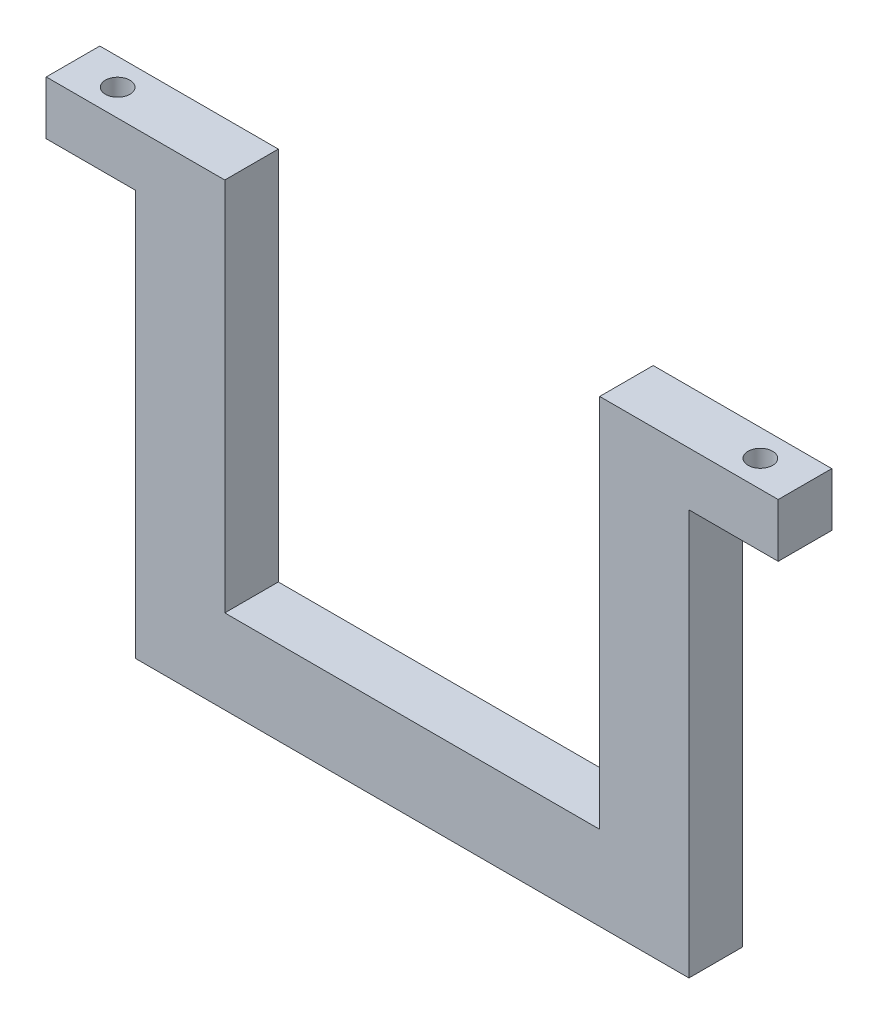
ISO-10303-21;
HEADER;
FILE_DESCRIPTION(('STEP AP214'),'2;1');
FILE_NAME('part.step','',(''),(''),'','','');
FILE_SCHEMA(('AUTOMOTIVE_DESIGN { 1 0 10303 214 1 1 1 1 }'));
ENDSEC;
DATA;
#1=APPLICATION_CONTEXT('core data for automotive mechanical design processes');
#2=APPLICATION_PROTOCOL_DEFINITION('international standard','automotive_design',2000,#1);
#3=PRODUCT_CONTEXT('',#1,'mechanical');
#4=PRODUCT('Part','Part','',(#3));
#5=PRODUCT_RELATED_PRODUCT_CATEGORY('part','',(#4));
#6=PRODUCT_DEFINITION_FORMATION('','',#4);
#7=PRODUCT_DEFINITION_CONTEXT('part definition',#1,'design');
#8=PRODUCT_DEFINITION('design','',#6,#7);
#9=PRODUCT_DEFINITION_SHAPE('','',#8);
#10=(LENGTH_UNIT() NAMED_UNIT(*) SI_UNIT(.MILLI.,.METRE.));
#11=(NAMED_UNIT(*) PLANE_ANGLE_UNIT() SI_UNIT($,.RADIAN.));
#12=(NAMED_UNIT(*) SI_UNIT($,.STERADIAN.) SOLID_ANGLE_UNIT());
#13=UNCERTAINTY_MEASURE_WITH_UNIT(LENGTH_MEASURE(1.E-05),#10,'distance_accuracy_value','');
#14=(GEOMETRIC_REPRESENTATION_CONTEXT(3) GLOBAL_UNCERTAINTY_ASSIGNED_CONTEXT((#13)) GLOBAL_UNIT_ASSIGNED_CONTEXT((#10,
#11,#12)) REPRESENTATION_CONTEXT('',''));
#15=CARTESIAN_POINT('',(0.,0.,0.));
#16=DIRECTION('',(0.,0.,1.));
#17=DIRECTION('',(1.,0.,0.));
#18=AXIS2_PLACEMENT_3D('',#15,#16,#17);
#19=CARTESIAN_POINT('',(-50.2278481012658,21.,6.));
#20=DIRECTION('',(1.,0.,0.));
#21=DIRECTION('',(0.,1.,0.));
#22=AXIS2_PLACEMENT_3D('',#19,#20,#21);
#23=PLANE('',#22);
#24=DIRECTION('',(0.,0.,1.));
#25=VECTOR('',#24,1.);
#26=CARTESIAN_POINT('',(-50.2278481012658,15.,0.));
#27=LINE('',#26,#25);
#28=CARTESIAN_POINT('',(-50.2278481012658,15.,0.));
#29=VERTEX_POINT('',#28);
#30=CARTESIAN_POINT('',(-50.2278481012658,15.,6.));
#31=VERTEX_POINT('',#30);
#32=EDGE_CURVE('E48',#29,#31,#27,.T.);
#33=ORIENTED_EDGE('',*,*,#32,.F.);
#34=DIRECTION('',(0.,-1.,0.));
#35=VECTOR('',#34,1.);
#36=CARTESIAN_POINT('',(-50.2278481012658,21.,0.));
#37=LINE('',#36,#35);
#38=CARTESIAN_POINT('',(-50.2278481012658,-30.4224633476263,0.));
#39=VERTEX_POINT('',#38);
#40=EDGE_CURVE('E147',#29,#39,#37,.T.);
#41=ORIENTED_EDGE('',*,*,#40,.T.);
#42=DIRECTION('',(0.,0.,-1.));
#43=VECTOR('',#42,1.);
#44=CARTESIAN_POINT('',(-50.2278481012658,-30.4224633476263,6.));
#45=LINE('',#44,#43);
#46=CARTESIAN_POINT('',(-50.2278481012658,-30.4224633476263,6.));
#47=VERTEX_POINT('',#46);
#48=EDGE_CURVE('E209',#47,#39,#45,.T.);
#49=ORIENTED_EDGE('',*,*,#48,.F.);
#50=DIRECTION('',(0.,-1.,0.));
#51=VECTOR('',#50,1.);
#52=CARTESIAN_POINT('',(-50.2278481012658,21.,6.));
#53=LINE('',#52,#51);
#54=EDGE_CURVE('E181',#31,#47,#53,.T.);
#55=ORIENTED_EDGE('',*,*,#54,.F.);
#56=EDGE_LOOP('',(#33,#41,#49,#55));
#57=FACE_BOUND('',#56,.T.);
#58=ADVANCED_FACE('F33',(#57),#23,.F.);
#59=CARTESIAN_POINT('',(11.7721518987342,21.,6.));
#60=DIRECTION('',(-1.,0.,0.));
#61=DIRECTION('',(0.,-1.,0.));
#62=AXIS2_PLACEMENT_3D('',#59,#60,#61);
#63=PLANE('',#62);
#64=DIRECTION('',(0.,0.,-1.));
#65=VECTOR('',#64,1.);
#66=CARTESIAN_POINT('',(11.7721518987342,15.,6.));
#67=LINE('',#66,#65);
#68=CARTESIAN_POINT('',(11.7721518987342,15.,6.));
#69=VERTEX_POINT('',#68);
#70=CARTESIAN_POINT('',(11.7721518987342,15.,0.));
#71=VERTEX_POINT('',#70);
#72=EDGE_CURVE('E56',#69,#71,#67,.T.);
#73=ORIENTED_EDGE('',*,*,#72,.F.);
#74=DIRECTION('',(0.,1.,0.));
#75=VECTOR('',#74,1.);
#76=CARTESIAN_POINT('',(11.7721518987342,21.,6.));
#77=LINE('',#76,#75);
#78=CARTESIAN_POINT('',(11.7721518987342,-30.4224633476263,6.));
#79=VERTEX_POINT('',#78);
#80=EDGE_CURVE('E185',#79,#69,#77,.T.);
#81=ORIENTED_EDGE('',*,*,#80,.F.);
#82=DIRECTION('',(0.,0.,-1.));
#83=VECTOR('',#82,1.);
#84=CARTESIAN_POINT('',(11.7721518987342,-30.4224633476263,6.));
#85=LINE('',#84,#83);
#86=CARTESIAN_POINT('',(11.7721518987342,-30.4224633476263,0.));
#87=VERTEX_POINT('',#86);
#88=EDGE_CURVE('E206',#79,#87,#85,.T.);
#89=ORIENTED_EDGE('',*,*,#88,.T.);
#90=DIRECTION('',(0.,1.,0.));
#91=VECTOR('',#90,1.);
#92=CARTESIAN_POINT('',(11.7721518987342,21.,0.));
#93=LINE('',#92,#91);
#94=EDGE_CURVE('E201',#87,#71,#93,.T.);
#95=ORIENTED_EDGE('',*,*,#94,.T.);
#96=EDGE_LOOP('',(#73,#81,#89,#95));
#97=FACE_BOUND('',#96,.T.);
#98=ADVANCED_FACE('F267',(#97),#63,.F.);
#99=CARTESIAN_POINT('',(1.77215189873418,21.,6.));
#100=DIRECTION('',(1.,0.,0.));
#101=DIRECTION('',(0.,0.,-1.));
#102=AXIS2_PLACEMENT_3D('',#99,#100,#101);
#103=PLANE('',#102);
#104=DIRECTION('',(0.,-1.,0.));
#105=VECTOR('',#104,1.);
#106=CARTESIAN_POINT('',(1.77215189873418,21.,0.));
#107=LINE('',#106,#105);
#108=CARTESIAN_POINT('',(1.77215189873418,21.,0.));
#109=VERTEX_POINT('',#108);
#110=CARTESIAN_POINT('',(1.77215189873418,-21.,0.));
#111=VERTEX_POINT('',#110);
#112=EDGE_CURVE('E170',#109,#111,#107,.T.);
#113=ORIENTED_EDGE('',*,*,#112,.T.);
#114=DIRECTION('',(0.,0.,-1.));
#115=VECTOR('',#114,1.);
#116=CARTESIAN_POINT('',(1.77215189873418,-21.,6.));
#117=LINE('',#116,#115);
#118=CARTESIAN_POINT('',(1.77215189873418,-21.,6.));
#119=VERTEX_POINT('',#118);
#120=EDGE_CURVE('E11',#119,#111,#117,.T.);
#121=ORIENTED_EDGE('',*,*,#120,.F.);
#122=DIRECTION('',(0.,-1.,0.));
#123=VECTOR('',#122,1.);
#124=CARTESIAN_POINT('',(1.77215189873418,21.,6.));
#125=LINE('',#124,#123);
#126=CARTESIAN_POINT('',(1.77215189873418,21.,6.));
#127=VERTEX_POINT('',#126);
#128=EDGE_CURVE('E171',#127,#119,#125,.T.);
#129=ORIENTED_EDGE('',*,*,#128,.F.);
#130=DIRECTION('',(0.,0.,-1.));
#131=VECTOR('',#130,1.);
#132=CARTESIAN_POINT('',(1.77215189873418,21.,6.));
#133=LINE('',#132,#131);
#134=EDGE_CURVE('E189',#127,#109,#133,.T.);
#135=ORIENTED_EDGE('',*,*,#134,.T.);
#136=EDGE_LOOP('',(#113,#121,#129,#135));
#137=FACE_BOUND('',#136,.T.);
#138=ADVANCED_FACE('F35',(#137),#103,.F.);
#139=CARTESIAN_POINT('',(-40.2278481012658,-21.,6.));
#140=DIRECTION('',(0.,-1.,0.));
#141=DIRECTION('',(0.,0.,-1.));
#142=AXIS2_PLACEMENT_3D('',#139,#140,#141);
#143=PLANE('',#142);
#144=DIRECTION('',(-1.,0.,0.));
#145=VECTOR('',#144,1.);
#146=CARTESIAN_POINT('',(-40.2278481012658,-21.,0.));
#147=LINE('',#146,#145);
#148=CARTESIAN_POINT('',(-40.2278481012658,-21.,0.));
#149=VERTEX_POINT('',#148);
#150=EDGE_CURVE('E192',#111,#149,#147,.T.);
#151=ORIENTED_EDGE('',*,*,#150,.T.);
#152=DIRECTION('',(0.,0.,-1.));
#153=VECTOR('',#152,1.);
#154=CARTESIAN_POINT('',(-40.2278481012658,-21.,6.));
#155=LINE('',#154,#153);
#156=CARTESIAN_POINT('',(-40.2278481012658,-21.,6.));
#157=VERTEX_POINT('',#156);
#158=EDGE_CURVE('E41',#157,#149,#155,.T.);
#159=ORIENTED_EDGE('',*,*,#158,.F.);
#160=DIRECTION('',(-1.,0.,0.));
#161=VECTOR('',#160,1.);
#162=CARTESIAN_POINT('',(-40.2278481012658,-21.,6.));
#163=LINE('',#162,#161);
#164=EDGE_CURVE('E174',#119,#157,#163,.T.);
#165=ORIENTED_EDGE('',*,*,#164,.F.);
#166=ORIENTED_EDGE('',*,*,#120,.T.);
#167=EDGE_LOOP('',(#151,#159,#165,#166));
#168=FACE_BOUND('',#167,.T.);
#169=ADVANCED_FACE('F282',(#168),#143,.F.);
#170=CARTESIAN_POINT('',(-40.2278481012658,21.,6.));
#171=DIRECTION('',(-1.,0.,0.));
#172=DIRECTION('',(0.,0.,1.));
#173=AXIS2_PLACEMENT_3D('',#170,#171,#172);
#174=PLANE('',#173);
#175=DIRECTION('',(0.,1.,0.));
#176=VECTOR('',#175,1.);
#177=CARTESIAN_POINT('',(-40.2278481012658,21.,0.));
#178=LINE('',#177,#176);
#179=CARTESIAN_POINT('',(-40.2278481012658,21.,0.));
#180=VERTEX_POINT('',#179);
#181=EDGE_CURVE('E194',#149,#180,#178,.T.);
#182=ORIENTED_EDGE('',*,*,#181,.T.);
#183=DIRECTION('',(0.,0.,-1.));
#184=VECTOR('',#183,1.);
#185=CARTESIAN_POINT('',(-40.2278481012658,21.,6.));
#186=LINE('',#185,#184);
#187=CARTESIAN_POINT('',(-40.2278481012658,21.,6.));
#188=VERTEX_POINT('',#187);
#189=EDGE_CURVE('E212',#188,#180,#186,.T.);
#190=ORIENTED_EDGE('',*,*,#189,.F.);
#191=DIRECTION('',(0.,1.,0.));
#192=VECTOR('',#191,1.);
#193=CARTESIAN_POINT('',(-40.2278481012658,21.,6.));
#194=LINE('',#193,#192);
#195=EDGE_CURVE('E177',#157,#188,#194,.T.);
#196=ORIENTED_EDGE('',*,*,#195,.F.);
#197=ORIENTED_EDGE('',*,*,#158,.T.);
#198=EDGE_LOOP('',(#182,#190,#196,#197));
#199=FACE_BOUND('',#198,.T.);
#200=ADVANCED_FACE('F219',(#199),#174,.F.);
#201=CARTESIAN_POINT('',(-50.2278481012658,21.,6.));
#202=DIRECTION('',(0.,-1.,0.));
#203=DIRECTION('',(0.,0.,-1.));
#204=AXIS2_PLACEMENT_3D('',#201,#202,#203);
#205=PLANE('',#204);
#206=CARTESIAN_POINT('',(-55.2278481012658,21.,3.));
#207=DIRECTION('',(0.,-1.,0.));
#208=DIRECTION('',(0.,0.,-1.));
#209=AXIS2_PLACEMENT_3D('',#206,#207,#208);
#210=CIRCLE('',#209,1.375);
#211=CARTESIAN_POINT('',(-55.2278481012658,21.,1.625));
#212=VERTEX_POINT('',#211);
#213=EDGE_CURVE('E229',#212,#212,#210,.T.);
#214=ORIENTED_EDGE('',*,*,#213,.T.);
#215=EDGE_LOOP('',(#214));
#216=FACE_BOUND('',#215,.T.);
#217=DIRECTION('',(-1.,0.,0.));
#218=VECTOR('',#217,1.);
#219=CARTESIAN_POINT('',(-50.2278481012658,21.,0.));
#220=LINE('',#219,#218);
#221=CARTESIAN_POINT('',(-60.2278481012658,21.,0.));
#222=VERTEX_POINT('',#221);
#223=EDGE_CURVE('E196',#180,#222,#220,.T.);
#224=ORIENTED_EDGE('',*,*,#223,.T.);
#225=DIRECTION('',(0.,0.,-1.));
#226=VECTOR('',#225,1.);
#227=CARTESIAN_POINT('',(-60.2278481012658,21.,0.));
#228=LINE('',#227,#226);
#229=CARTESIAN_POINT('',(-60.2278481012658,21.,6.));
#230=VERTEX_POINT('',#229);
#231=EDGE_CURVE('E140',#230,#222,#228,.T.);
#232=ORIENTED_EDGE('',*,*,#231,.F.);
#233=DIRECTION('',(-1.,0.,0.));
#234=VECTOR('',#233,1.);
#235=CARTESIAN_POINT('',(-50.2278481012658,21.,6.));
#236=LINE('',#235,#234);
#237=EDGE_CURVE('E179',#188,#230,#236,.T.);
#238=ORIENTED_EDGE('',*,*,#237,.F.);
#239=ORIENTED_EDGE('',*,*,#189,.T.);
#240=EDGE_LOOP('',(#224,#232,#238,#239));
#241=FACE_BOUND('',#240,.T.);
#242=ADVANCED_FACE('F223',(#216,#241),#205,.F.);
#243=CARTESIAN_POINT('',(-50.2278481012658,-30.4224633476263,6.));
#244=DIRECTION('',(0.,1.,0.));
#245=DIRECTION('',(0.,0.,1.));
#246=AXIS2_PLACEMENT_3D('',#243,#244,#245);
#247=PLANE('',#246);
#248=DIRECTION('',(1.,0.,0.));
#249=VECTOR('',#248,1.);
#250=CARTESIAN_POINT('',(-50.2278481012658,-30.4224633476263,0.));
#251=LINE('',#250,#249);
#252=EDGE_CURVE('E199',#39,#87,#251,.T.);
#253=ORIENTED_EDGE('',*,*,#252,.T.);
#254=ORIENTED_EDGE('',*,*,#88,.F.);
#255=DIRECTION('',(1.,0.,0.));
#256=VECTOR('',#255,1.);
#257=CARTESIAN_POINT('',(-50.2278481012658,-30.4224633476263,6.));
#258=LINE('',#257,#256);
#259=EDGE_CURVE('E183',#47,#79,#258,.T.);
#260=ORIENTED_EDGE('',*,*,#259,.F.);
#261=ORIENTED_EDGE('',*,*,#48,.T.);
#262=EDGE_LOOP('',(#253,#254,#260,#261));
#263=FACE_BOUND('',#262,.T.);
#264=ADVANCED_FACE('F269',(#263),#247,.F.);
#265=CARTESIAN_POINT('',(1.77215189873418,21.,6.));
#266=DIRECTION('',(0.,-1.,0.));
#267=DIRECTION('',(0.,0.,-1.));
#268=AXIS2_PLACEMENT_3D('',#265,#266,#267);
#269=PLANE('',#268);
#270=CARTESIAN_POINT('',(16.7721518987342,21.,3.));
#271=DIRECTION('',(0.,-1.,0.));
#272=DIRECTION('',(0.,0.,-1.));
#273=AXIS2_PLACEMENT_3D('',#270,#271,#272);
#274=CIRCLE('',#273,1.375);
#275=CARTESIAN_POINT('',(16.7721518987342,21.,1.625));
#276=VERTEX_POINT('',#275);
#277=EDGE_CURVE('E236',#276,#276,#274,.T.);
#278=ORIENTED_EDGE('',*,*,#277,.T.);
#279=EDGE_LOOP('',(#278));
#280=FACE_BOUND('',#279,.T.);
#281=DIRECTION('',(-1.,0.,0.));
#282=VECTOR('',#281,1.);
#283=CARTESIAN_POINT('',(1.77215189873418,21.,0.));
#284=LINE('',#283,#282);
#285=CARTESIAN_POINT('',(21.7721518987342,21.,0.));
#286=VERTEX_POINT('',#285);
#287=EDGE_CURVE('E175',#286,#109,#284,.T.);
#288=ORIENTED_EDGE('',*,*,#287,.T.);
#289=ORIENTED_EDGE('',*,*,#134,.F.);
#290=DIRECTION('',(-1.,0.,0.));
#291=VECTOR('',#290,1.);
#292=CARTESIAN_POINT('',(1.77215189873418,21.,6.));
#293=LINE('',#292,#291);
#294=CARTESIAN_POINT('',(21.7721518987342,21.,6.));
#295=VERTEX_POINT('',#294);
#296=EDGE_CURVE('E187',#295,#127,#293,.T.);
#297=ORIENTED_EDGE('',*,*,#296,.F.);
#298=DIRECTION('',(0.,0.,1.));
#299=VECTOR('',#298,1.);
#300=CARTESIAN_POINT('',(21.7721518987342,21.,6.));
#301=LINE('',#300,#299);
#302=EDGE_CURVE('E161',#286,#295,#301,.T.);
#303=ORIENTED_EDGE('',*,*,#302,.F.);
#304=EDGE_LOOP('',(#288,#289,#297,#303));
#305=FACE_BOUND('',#304,.T.);
#306=ADVANCED_FACE('F261',(#280,#305),#269,.F.);
#307=CARTESIAN_POINT('',(0.,0.,6.));
#308=DIRECTION('',(0.,0.,1.));
#309=DIRECTION('',(1.,0.,0.));
#310=AXIS2_PLACEMENT_3D('',#307,#308,#309);
#311=PLANE('',#310);
#312=ORIENTED_EDGE('',*,*,#128,.T.);
#313=ORIENTED_EDGE('',*,*,#164,.T.);
#314=ORIENTED_EDGE('',*,*,#195,.T.);
#315=ORIENTED_EDGE('',*,*,#237,.T.);
#316=DIRECTION('',(0.,1.,0.));
#317=VECTOR('',#316,1.);
#318=CARTESIAN_POINT('',(-60.2278481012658,21.,6.));
#319=LINE('',#318,#317);
#320=CARTESIAN_POINT('',(-60.2278481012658,15.,6.));
#321=VERTEX_POINT('',#320);
#322=EDGE_CURVE('E133',#321,#230,#319,.T.);
#323=ORIENTED_EDGE('',*,*,#322,.F.);
#324=DIRECTION('',(1.,0.,0.));
#325=VECTOR('',#324,1.);
#326=CARTESIAN_POINT('',(-60.2278481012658,15.,6.));
#327=LINE('',#326,#325);
#328=EDGE_CURVE('E129',#321,#31,#327,.T.);
#329=ORIENTED_EDGE('',*,*,#328,.T.);
#330=ORIENTED_EDGE('',*,*,#54,.T.);
#331=ORIENTED_EDGE('',*,*,#259,.T.);
#332=ORIENTED_EDGE('',*,*,#80,.T.);
#333=DIRECTION('',(-1.,0.,0.));
#334=VECTOR('',#333,1.);
#335=CARTESIAN_POINT('',(21.7721518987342,15.,6.));
#336=LINE('',#335,#334);
#337=CARTESIAN_POINT('',(21.7721518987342,15.,6.));
#338=VERTEX_POINT('',#337);
#339=EDGE_CURVE('E167',#338,#69,#336,.T.);
#340=ORIENTED_EDGE('',*,*,#339,.F.);
#341=DIRECTION('',(0.,-1.,0.));
#342=VECTOR('',#341,1.);
#343=CARTESIAN_POINT('',(21.7721518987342,21.,6.));
#344=LINE('',#343,#342);
#345=EDGE_CURVE('E149',#295,#338,#344,.T.);
#346=ORIENTED_EDGE('',*,*,#345,.F.);
#347=ORIENTED_EDGE('',*,*,#296,.T.);
#348=EDGE_LOOP('',(#312,#313,#314,#315,#323,#329,#330,#331,#332,#340,#346,#347));
#349=FACE_BOUND('',#348,.T.);
#350=ADVANCED_FACE('F226',(#349),#311,.T.);
#351=CARTESIAN_POINT('',(0.,0.,0.));
#352=DIRECTION('',(0.,0.,1.));
#353=DIRECTION('',(1.,0.,0.));
#354=AXIS2_PLACEMENT_3D('',#351,#352,#353);
#355=PLANE('',#354);
#356=ORIENTED_EDGE('',*,*,#112,.F.);
#357=ORIENTED_EDGE('',*,*,#287,.F.);
#358=DIRECTION('',(0.,1.,0.));
#359=VECTOR('',#358,1.);
#360=CARTESIAN_POINT('',(21.7721518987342,21.,0.));
#361=LINE('',#360,#359);
#362=CARTESIAN_POINT('',(21.7721518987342,15.,0.));
#363=VERTEX_POINT('',#362);
#364=EDGE_CURVE('E158',#363,#286,#361,.T.);
#365=ORIENTED_EDGE('',*,*,#364,.F.);
#366=DIRECTION('',(-1.,0.,0.));
#367=VECTOR('',#366,1.);
#368=CARTESIAN_POINT('',(21.7721518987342,15.,0.));
#369=LINE('',#368,#367);
#370=EDGE_CURVE('E163',#363,#71,#369,.T.);
#371=ORIENTED_EDGE('',*,*,#370,.T.);
#372=ORIENTED_EDGE('',*,*,#94,.F.);
#373=ORIENTED_EDGE('',*,*,#252,.F.);
#374=ORIENTED_EDGE('',*,*,#40,.F.);
#375=DIRECTION('',(1.,0.,0.));
#376=VECTOR('',#375,1.);
#377=CARTESIAN_POINT('',(-60.2278481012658,15.,0.));
#378=LINE('',#377,#376);
#379=CARTESIAN_POINT('',(-60.2278481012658,15.,0.));
#380=VERTEX_POINT('',#379);
#381=EDGE_CURVE('E127',#380,#29,#378,.T.);
#382=ORIENTED_EDGE('',*,*,#381,.F.);
#383=DIRECTION('',(0.,-1.,0.));
#384=VECTOR('',#383,1.);
#385=CARTESIAN_POINT('',(-60.2278481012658,21.,0.));
#386=LINE('',#385,#384);
#387=EDGE_CURVE('E134',#222,#380,#386,.T.);
#388=ORIENTED_EDGE('',*,*,#387,.F.);
#389=ORIENTED_EDGE('',*,*,#223,.F.);
#390=ORIENTED_EDGE('',*,*,#181,.F.);
#391=ORIENTED_EDGE('',*,*,#150,.F.);
#392=EDGE_LOOP('',(#356,#357,#365,#371,#372,#373,#374,#382,#388,#389,#390,#391));
#393=FACE_BOUND('',#392,.T.);
#394=ADVANCED_FACE('F145',(#393),#355,.F.);
#395=CARTESIAN_POINT('',(21.7721518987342,15.,6.));
#396=DIRECTION('',(0.,1.,0.));
#397=DIRECTION('',(-1.,0.,0.));
#398=AXIS2_PLACEMENT_3D('',#395,#396,#397);
#399=PLANE('',#398);
#400=CARTESIAN_POINT('',(16.7721518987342,15.,3.));
#401=DIRECTION('',(0.,-1.,0.));
#402=DIRECTION('',(1.,0.,0.));
#403=AXIS2_PLACEMENT_3D('',#400,#401,#402);
#404=CIRCLE('',#403,1.375);
#405=CARTESIAN_POINT('',(18.1471518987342,15.,3.));
#406=VERTEX_POINT('',#405);
#407=EDGE_CURVE('E241',#406,#406,#404,.T.);
#408=ORIENTED_EDGE('',*,*,#407,.F.);
#409=EDGE_LOOP('',(#408));
#410=FACE_BOUND('',#409,.T.);
#411=ORIENTED_EDGE('',*,*,#72,.T.);
#412=ORIENTED_EDGE('',*,*,#370,.F.);
#413=DIRECTION('',(0.,0.,-1.));
#414=VECTOR('',#413,1.);
#415=CARTESIAN_POINT('',(21.7721518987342,15.,6.));
#416=LINE('',#415,#414);
#417=EDGE_CURVE('E156',#338,#363,#416,.T.);
#418=ORIENTED_EDGE('',*,*,#417,.F.);
#419=ORIENTED_EDGE('',*,*,#339,.T.);
#420=EDGE_LOOP('',(#411,#412,#418,#419));
#421=FACE_BOUND('',#420,.T.);
#422=ADVANCED_FACE('F248',(#410,#421),#399,.F.);
#423=CARTESIAN_POINT('',(21.7721518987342,0.,0.));
#424=DIRECTION('',(1.,0.,0.));
#425=DIRECTION('',(0.,1.,0.));
#426=AXIS2_PLACEMENT_3D('',#423,#424,#425);
#427=PLANE('',#426);
#428=ORIENTED_EDGE('',*,*,#345,.T.);
#429=ORIENTED_EDGE('',*,*,#417,.T.);
#430=ORIENTED_EDGE('',*,*,#364,.T.);
#431=ORIENTED_EDGE('',*,*,#302,.T.);
#432=EDGE_LOOP('',(#428,#429,#430,#431));
#433=FACE_BOUND('',#432,.T.);
#434=ADVANCED_FACE('F251',(#433),#427,.T.);
#435=CARTESIAN_POINT('',(-60.2278481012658,15.,0.));
#436=DIRECTION('',(0.,1.,0.));
#437=DIRECTION('',(-1.,0.,0.));
#438=AXIS2_PLACEMENT_3D('',#435,#436,#437);
#439=PLANE('',#438);
#440=CARTESIAN_POINT('',(-55.2278481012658,15.,3.));
#441=DIRECTION('',(0.,-1.,0.));
#442=DIRECTION('',(1.,0.,0.));
#443=AXIS2_PLACEMENT_3D('',#440,#441,#442);
#444=CIRCLE('',#443,1.375);
#445=CARTESIAN_POINT('',(-53.8528481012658,15.,3.));
#446=VERTEX_POINT('',#445);
#447=EDGE_CURVE('E231',#446,#446,#444,.T.);
#448=ORIENTED_EDGE('',*,*,#447,.F.);
#449=EDGE_LOOP('',(#448));
#450=FACE_BOUND('',#449,.T.);
#451=ORIENTED_EDGE('',*,*,#32,.T.);
#452=ORIENTED_EDGE('',*,*,#328,.F.);
#453=DIRECTION('',(0.,0.,1.));
#454=VECTOR('',#453,1.);
#455=CARTESIAN_POINT('',(-60.2278481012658,15.,0.));
#456=LINE('',#455,#454);
#457=EDGE_CURVE('E123',#380,#321,#456,.T.);
#458=ORIENTED_EDGE('',*,*,#457,.F.);
#459=ORIENTED_EDGE('',*,*,#381,.T.);
#460=EDGE_LOOP('',(#451,#452,#458,#459));
#461=FACE_BOUND('',#460,.T.);
#462=ADVANCED_FACE('F125',(#450,#461),#439,.F.);
#463=CARTESIAN_POINT('',(-60.2278481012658,0.,0.));
#464=DIRECTION('',(-1.,0.,0.));
#465=DIRECTION('',(0.,0.,1.));
#466=AXIS2_PLACEMENT_3D('',#463,#464,#465);
#467=PLANE('',#466);
#468=ORIENTED_EDGE('',*,*,#387,.T.);
#469=ORIENTED_EDGE('',*,*,#457,.T.);
#470=ORIENTED_EDGE('',*,*,#322,.T.);
#471=ORIENTED_EDGE('',*,*,#231,.T.);
#472=EDGE_LOOP('',(#468,#469,#470,#471));
#473=FACE_BOUND('',#472,.T.);
#474=ADVANCED_FACE('F138',(#473),#467,.T.);
#475=CARTESIAN_POINT('',(-55.2278481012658,25.,3.));
#476=DIRECTION('',(0.,-1.,0.));
#477=DIRECTION('',(1.,0.,0.));
#478=AXIS2_PLACEMENT_3D('',#475,#476,#477);
#479=CYLINDRICAL_SURFACE('',#478,1.375);
#480=ORIENTED_EDGE('',*,*,#447,.T.);
#481=EDGE_LOOP('',(#480));
#482=FACE_BOUND('',#481,.T.);
#483=ORIENTED_EDGE('',*,*,#213,.F.);
#484=EDGE_LOOP('',(#483));
#485=FACE_BOUND('',#484,.T.);
#486=ADVANCED_FACE('F345',(#482,#485),#479,.F.);
#487=CARTESIAN_POINT('',(16.7721518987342,25.,3.));
#488=DIRECTION('',(0.,-1.,0.));
#489=DIRECTION('',(1.,0.,0.));
#490=AXIS2_PLACEMENT_3D('',#487,#488,#489);
#491=CYLINDRICAL_SURFACE('',#490,1.375);
#492=ORIENTED_EDGE('',*,*,#407,.T.);
#493=EDGE_LOOP('',(#492));
#494=FACE_BOUND('',#493,.T.);
#495=ORIENTED_EDGE('',*,*,#277,.F.);
#496=EDGE_LOOP('',(#495));
#497=FACE_BOUND('',#496,.T.);
#498=ADVANCED_FACE('F245',(#494,#497),#491,.F.);
#499=CLOSED_SHELL('',(#58,#98,#138,#169,#200,#242,#264,#306,#350,#394,#422,#434,#462,#474,#486,#498));
#500=MANIFOLD_SOLID_BREP('B2',#499);
#501=ADVANCED_BREP_SHAPE_REPRESENTATION('',(#18,#500),#14);
#502=SHAPE_DEFINITION_REPRESENTATION(#9,#501);
ENDSEC;
END-ISO-10303-21;
